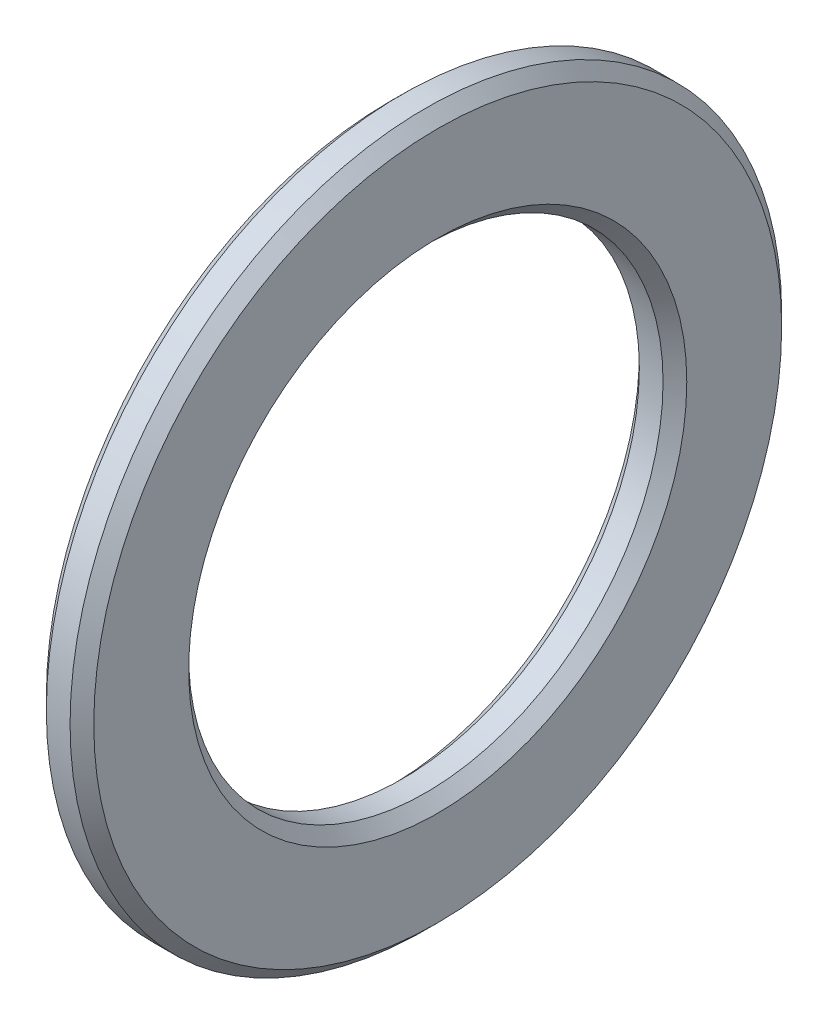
ISO-10303-21;
HEADER;
FILE_DESCRIPTION(('STEP AP214'),'2;1');
FILE_NAME('part.step','',(''),(''),'','','');
FILE_SCHEMA(('AUTOMOTIVE_DESIGN { 1 0 10303 214 1 1 1 1 }'));
ENDSEC;
DATA;
#1=APPLICATION_CONTEXT('core data for automotive mechanical design processes');
#2=APPLICATION_PROTOCOL_DEFINITION('international standard','automotive_design',2000,#1);
#3=PRODUCT_CONTEXT('',#1,'mechanical');
#4=PRODUCT('Part','Part','',(#3));
#5=PRODUCT_RELATED_PRODUCT_CATEGORY('part','',(#4));
#6=PRODUCT_DEFINITION_FORMATION('','',#4);
#7=PRODUCT_DEFINITION_CONTEXT('part definition',#1,'design');
#8=PRODUCT_DEFINITION('design','',#6,#7);
#9=PRODUCT_DEFINITION_SHAPE('','',#8);
#10=(LENGTH_UNIT() NAMED_UNIT(*) SI_UNIT(.MILLI.,.METRE.));
#11=(NAMED_UNIT(*) PLANE_ANGLE_UNIT() SI_UNIT($,.RADIAN.));
#12=(NAMED_UNIT(*) SI_UNIT($,.STERADIAN.) SOLID_ANGLE_UNIT());
#13=UNCERTAINTY_MEASURE_WITH_UNIT(LENGTH_MEASURE(1.E-05),#10,'distance_accuracy_value','');
#14=(GEOMETRIC_REPRESENTATION_CONTEXT(3) GLOBAL_UNCERTAINTY_ASSIGNED_CONTEXT((#13)) GLOBAL_UNIT_ASSIGNED_CONTEXT((#10,
#11,#12)) REPRESENTATION_CONTEXT('',''));
#15=CARTESIAN_POINT('',(0.,0.,0.));
#16=DIRECTION('',(0.,0.,1.));
#17=DIRECTION('',(1.,0.,0.));
#18=AXIS2_PLACEMENT_3D('',#15,#16,#17);
#19=CARTESIAN_POINT('',(2.,0.,0.));
#20=DIRECTION('',(1.,0.,0.));
#21=DIRECTION('',(0.,0.,-1.));
#22=AXIS2_PLACEMENT_3D('',#19,#20,#21);
#23=PLANE('',#22);
#24=CARTESIAN_POINT('',(2.00000000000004,0.,0.));
#25=DIRECTION('',(1.,0.,0.));
#26=DIRECTION('',(0.,0.,-1.));
#27=AXIS2_PLACEMENT_3D('',#24,#25,#26);
#28=CIRCLE('',#27,10.5);
#29=CARTESIAN_POINT('',(2.00000000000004,0.,-10.5));
#30=VERTEX_POINT('',#29);
#31=EDGE_CURVE('E31',#30,#30,#28,.F.);
#32=ORIENTED_EDGE('',*,*,#31,.T.);
#33=EDGE_LOOP('',(#32));
#34=FACE_BOUND('',#33,.T.);
#35=CARTESIAN_POINT('',(2.00000000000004,0.,0.));
#36=DIRECTION('',(-1.,0.,0.));
#37=DIRECTION('',(0.,0.,1.));
#38=AXIS2_PLACEMENT_3D('',#35,#36,#37);
#39=CIRCLE('',#38,14.5);
#40=CARTESIAN_POINT('',(2.00000000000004,0.,14.5));
#41=VERTEX_POINT('',#40);
#42=EDGE_CURVE('E17',#41,#41,#39,.T.);
#43=ORIENTED_EDGE('',*,*,#42,.F.);
#44=EDGE_LOOP('',(#43));
#45=FACE_BOUND('',#44,.T.);
#46=ADVANCED_FACE('F14',(#34,#45),#23,.T.);
#47=CARTESIAN_POINT('',(1.49999999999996,0.,0.));
#48=DIRECTION('',(-1.,0.,0.));
#49=DIRECTION('',(0.,0.,1.));
#50=AXIS2_PLACEMENT_3D('',#47,#48,#49);
#51=CONICAL_SURFACE('',#50,15.,0.785398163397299);
#52=CARTESIAN_POINT('',(1.5,0.,0.));
#53=DIRECTION('',(1.,0.,0.));
#54=DIRECTION('',(0.,0.,-1.));
#55=AXIS2_PLACEMENT_3D('',#52,#53,#54);
#56=CIRCLE('',#55,15.);
#57=CARTESIAN_POINT('',(1.5,0.,-15.));
#58=VERTEX_POINT('',#57);
#59=EDGE_CURVE('E29',#58,#58,#56,.F.);
#60=ORIENTED_EDGE('',*,*,#59,.F.);
#61=EDGE_LOOP('',(#60));
#62=FACE_BOUND('',#61,.T.);
#63=ORIENTED_EDGE('',*,*,#42,.T.);
#64=EDGE_LOOP('',(#63));
#65=FACE_BOUND('',#64,.T.);
#66=ADVANCED_FACE('F40',(#62,#65),#51,.T.);
#67=CARTESIAN_POINT('',(2.00000000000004,0.,0.));
#68=DIRECTION('',(1.,0.,0.));
#69=DIRECTION('',(0.,0.,-1.));
#70=AXIS2_PLACEMENT_3D('',#67,#68,#69);
#71=CONICAL_SURFACE('',#70,10.5,0.785398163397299);
#72=CARTESIAN_POINT('',(1.5,0.,0.));
#73=DIRECTION('',(1.,0.,0.));
#74=DIRECTION('',(0.,0.,-1.));
#75=AXIS2_PLACEMENT_3D('',#72,#73,#74);
#76=CIRCLE('',#75,10.);
#77=CARTESIAN_POINT('',(1.5,0.,-10.));
#78=VERTEX_POINT('',#77);
#79=EDGE_CURVE('E36',#78,#78,#76,.F.);
#80=ORIENTED_EDGE('',*,*,#79,.T.);
#81=EDGE_LOOP('',(#80));
#82=FACE_BOUND('',#81,.T.);
#83=ORIENTED_EDGE('',*,*,#31,.F.);
#84=EDGE_LOOP('',(#83));
#85=FACE_BOUND('',#84,.T.);
#86=ADVANCED_FACE('F48',(#82,#85),#71,.F.);
#87=CARTESIAN_POINT('',(0.,0.,0.));
#88=DIRECTION('',(1.,0.,0.));
#89=DIRECTION('',(0.,0.,-1.));
#90=AXIS2_PLACEMENT_3D('',#87,#88,#89);
#91=CYLINDRICAL_SURFACE('',#90,15.);
#92=ORIENTED_EDGE('',*,*,#59,.T.);
#93=EDGE_LOOP('',(#92));
#94=FACE_BOUND('',#93,.T.);
#95=CARTESIAN_POINT('',(0.500000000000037,0.,0.));
#96=DIRECTION('',(1.,0.,0.));
#97=DIRECTION('',(0.,0.,-1.));
#98=AXIS2_PLACEMENT_3D('',#95,#96,#97);
#99=CIRCLE('',#98,15.);
#100=CARTESIAN_POINT('',(0.500000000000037,0.,-15.));
#101=VERTEX_POINT('',#100);
#102=EDGE_CURVE('E83',#101,#101,#99,.F.);
#103=ORIENTED_EDGE('',*,*,#102,.F.);
#104=EDGE_LOOP('',(#103));
#105=FACE_BOUND('',#104,.T.);
#106=ADVANCED_FACE('F70',(#94,#105),#91,.T.);
#107=CARTESIAN_POINT('',(0.,0.,0.));
#108=DIRECTION('',(1.,0.,0.));
#109=DIRECTION('',(0.,0.,-1.));
#110=AXIS2_PLACEMENT_3D('',#107,#108,#109);
#111=CYLINDRICAL_SURFACE('',#110,10.);
#112=ORIENTED_EDGE('',*,*,#79,.F.);
#113=EDGE_LOOP('',(#112));
#114=FACE_BOUND('',#113,.T.);
#115=CARTESIAN_POINT('',(0.500000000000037,0.,0.));
#116=DIRECTION('',(-1.,0.,0.));
#117=DIRECTION('',(0.,0.,1.));
#118=AXIS2_PLACEMENT_3D('',#115,#116,#117);
#119=CIRCLE('',#118,10.);
#120=CARTESIAN_POINT('',(0.500000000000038,0.,10.));
#121=VERTEX_POINT('',#120);
#122=EDGE_CURVE('E26',#121,#121,#119,.T.);
#123=ORIENTED_EDGE('',*,*,#122,.T.);
#124=EDGE_LOOP('',(#123));
#125=FACE_BOUND('',#124,.T.);
#126=ADVANCED_FACE('F66',(#114,#125),#111,.F.);
#127=CARTESIAN_POINT('',(0.500000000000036,0.,0.));
#128=DIRECTION('',(1.,0.,0.));
#129=DIRECTION('',(0.,0.,-1.));
#130=AXIS2_PLACEMENT_3D('',#127,#128,#129);
#131=CONICAL_SURFACE('',#130,15.,0.785398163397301);
#132=ORIENTED_EDGE('',*,*,#102,.T.);
#133=EDGE_LOOP('',(#132));
#134=FACE_BOUND('',#133,.T.);
#135=CARTESIAN_POINT('',(0.,0.,0.));
#136=DIRECTION('',(1.,0.,0.));
#137=DIRECTION('',(0.,0.,-1.));
#138=AXIS2_PLACEMENT_3D('',#135,#136,#137);
#139=CIRCLE('',#138,14.5);
#140=CARTESIAN_POINT('',(0.,0.,-14.5));
#141=VERTEX_POINT('',#140);
#142=EDGE_CURVE('E21',#141,#141,#139,.T.);
#143=ORIENTED_EDGE('',*,*,#142,.T.);
#144=EDGE_LOOP('',(#143));
#145=FACE_BOUND('',#144,.T.);
#146=ADVANCED_FACE('F59',(#134,#145),#131,.T.);
#147=CARTESIAN_POINT('',(0.,0.,0.));
#148=DIRECTION('',(-1.,0.,0.));
#149=DIRECTION('',(0.,0.,1.));
#150=AXIS2_PLACEMENT_3D('',#147,#148,#149);
#151=CONICAL_SURFACE('',#150,10.5,0.7853981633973);
#152=ORIENTED_EDGE('',*,*,#122,.F.);
#153=EDGE_LOOP('',(#152));
#154=FACE_BOUND('',#153,.T.);
#155=CARTESIAN_POINT('',(0.,0.,0.));
#156=DIRECTION('',(-1.,0.,0.));
#157=DIRECTION('',(0.,0.,1.));
#158=AXIS2_PLACEMENT_3D('',#155,#156,#157);
#159=CIRCLE('',#158,10.5);
#160=CARTESIAN_POINT('',(0.,0.,10.5));
#161=VERTEX_POINT('',#160);
#162=EDGE_CURVE('E10',#161,#161,#159,.T.);
#163=ORIENTED_EDGE('',*,*,#162,.T.);
#164=EDGE_LOOP('',(#163));
#165=FACE_BOUND('',#164,.T.);
#166=ADVANCED_FACE('F52',(#154,#165),#151,.F.);
#167=CARTESIAN_POINT('',(0.,0.,0.));
#168=DIRECTION('',(1.,0.,0.));
#169=DIRECTION('',(0.,0.,-1.));
#170=AXIS2_PLACEMENT_3D('',#167,#168,#169);
#171=PLANE('',#170);
#172=ORIENTED_EDGE('',*,*,#162,.F.);
#173=EDGE_LOOP('',(#172));
#174=FACE_BOUND('',#173,.T.);
#175=ORIENTED_EDGE('',*,*,#142,.F.);
#176=EDGE_LOOP('',(#175));
#177=FACE_BOUND('',#176,.T.);
#178=ADVANCED_FACE('F50',(#174,#177),#171,.F.);
#179=CLOSED_SHELL('',(#46,#66,#86,#106,#126,#146,#166,#178));
#180=MANIFOLD_SOLID_BREP('B1',#179);
#181=ADVANCED_BREP_SHAPE_REPRESENTATION('',(#18,#180),#14);
#182=SHAPE_DEFINITION_REPRESENTATION(#9,#181);
ENDSEC;
END-ISO-10303-21;
